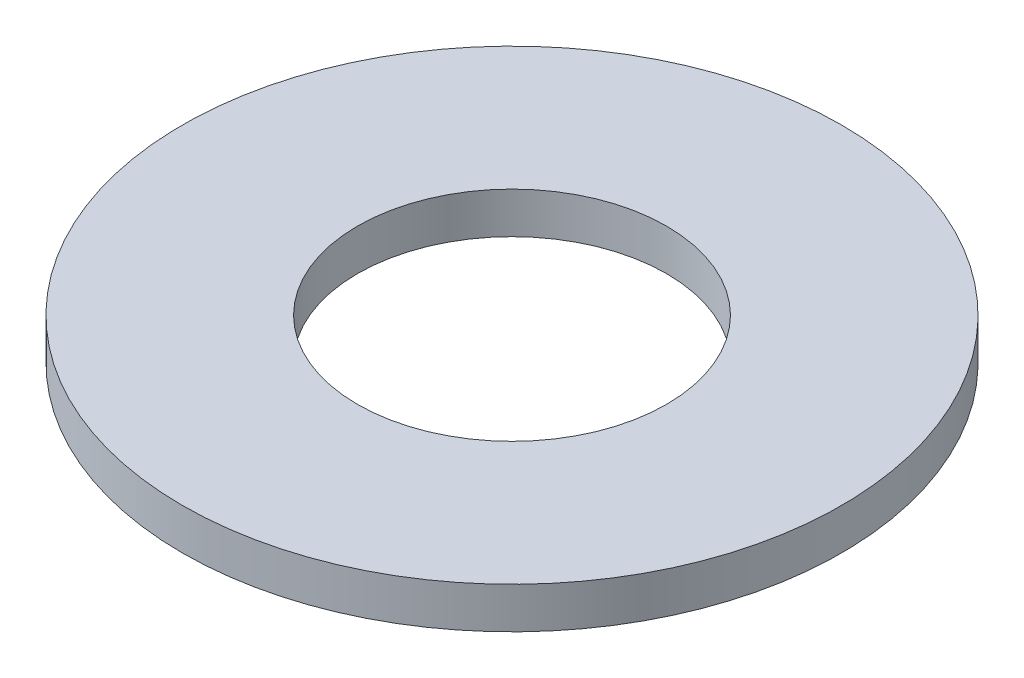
ISO-10303-21;
HEADER;
FILE_DESCRIPTION(('STEP AP214'),'2;1');
FILE_NAME('part.step','',(''),(''),'','','');
FILE_SCHEMA(('AUTOMOTIVE_DESIGN { 1 0 10303 214 1 1 1 1 }'));
ENDSEC;
DATA;
#1=APPLICATION_CONTEXT('core data for automotive mechanical design processes');
#2=APPLICATION_PROTOCOL_DEFINITION('international standard','automotive_design',2000,#1);
#3=PRODUCT_CONTEXT('',#1,'mechanical');
#4=PRODUCT('Part','Part','',(#3));
#5=PRODUCT_RELATED_PRODUCT_CATEGORY('part','',(#4));
#6=PRODUCT_DEFINITION_FORMATION('','',#4);
#7=PRODUCT_DEFINITION_CONTEXT('part definition',#1,'design');
#8=PRODUCT_DEFINITION('design','',#6,#7);
#9=PRODUCT_DEFINITION_SHAPE('','',#8);
#10=(LENGTH_UNIT() NAMED_UNIT(*) SI_UNIT(.MILLI.,.METRE.));
#11=(NAMED_UNIT(*) PLANE_ANGLE_UNIT() SI_UNIT($,.RADIAN.));
#12=(NAMED_UNIT(*) SI_UNIT($,.STERADIAN.) SOLID_ANGLE_UNIT());
#13=UNCERTAINTY_MEASURE_WITH_UNIT(LENGTH_MEASURE(1.E-05),#10,'distance_accuracy_value','');
#14=(GEOMETRIC_REPRESENTATION_CONTEXT(3) GLOBAL_UNCERTAINTY_ASSIGNED_CONTEXT((#13)) GLOBAL_UNIT_ASSIGNED_CONTEXT((#10,
#11,#12)) REPRESENTATION_CONTEXT('',''));
#15=CARTESIAN_POINT('',(0.,0.,0.));
#16=DIRECTION('',(0.,0.,1.));
#17=DIRECTION('',(1.,0.,0.));
#18=AXIS2_PLACEMENT_3D('',#15,#16,#17);
#19=CARTESIAN_POINT('',(0.,6.35,0.));
#20=DIRECTION('',(0.,-1.,0.));
#21=DIRECTION('',(0.,0.,-1.));
#22=AXIS2_PLACEMENT_3D('',#19,#20,#21);
#23=CYLINDRICAL_SURFACE('',#22,50.8);
#24=CARTESIAN_POINT('',(0.,6.35,0.));
#25=DIRECTION('',(0.,1.,0.));
#26=DIRECTION('',(0.,0.,1.));
#27=AXIS2_PLACEMENT_3D('',#24,#25,#26);
#28=CIRCLE('',#27,50.8);
#29=CARTESIAN_POINT('',(0.,6.35,50.8));
#30=VERTEX_POINT('',#29);
#31=EDGE_CURVE('E10',#30,#30,#28,.T.);
#32=ORIENTED_EDGE('',*,*,#31,.F.);
#33=EDGE_LOOP('',(#32));
#34=FACE_BOUND('',#33,.T.);
#35=CARTESIAN_POINT('',(0.,0.,0.));
#36=DIRECTION('',(0.,1.,0.));
#37=DIRECTION('',(0.,0.,1.));
#38=AXIS2_PLACEMENT_3D('',#35,#36,#37);
#39=CIRCLE('',#38,50.8);
#40=CARTESIAN_POINT('',(0.,0.,50.8));
#41=VERTEX_POINT('',#40);
#42=EDGE_CURVE('E32',#41,#41,#39,.T.);
#43=ORIENTED_EDGE('',*,*,#42,.T.);
#44=EDGE_LOOP('',(#43));
#45=FACE_BOUND('',#44,.T.);
#46=ADVANCED_FACE('F29',(#34,#45),#23,.T.);
#47=CARTESIAN_POINT('',(0.,6.35,0.));
#48=DIRECTION('',(0.,1.,0.));
#49=DIRECTION('',(0.,0.,1.));
#50=AXIS2_PLACEMENT_3D('',#47,#48,#49);
#51=PLANE('',#50);
#52=CARTESIAN_POINT('',(0.,6.35,0.));
#53=DIRECTION('',(0.,1.,0.));
#54=DIRECTION('',(0.,0.,1.));
#55=AXIS2_PLACEMENT_3D('',#52,#53,#54);
#56=CIRCLE('',#55,23.8125);
#57=CARTESIAN_POINT('',(0.,6.35,23.8125));
#58=VERTEX_POINT('',#57);
#59=EDGE_CURVE('E41',#58,#58,#56,.T.);
#60=ORIENTED_EDGE('',*,*,#59,.F.);
#61=EDGE_LOOP('',(#60));
#62=FACE_BOUND('',#61,.T.);
#63=ORIENTED_EDGE('',*,*,#31,.T.);
#64=EDGE_LOOP('',(#63));
#65=FACE_BOUND('',#64,.T.);
#66=ADVANCED_FACE('F56',(#62,#65),#51,.T.);
#67=CARTESIAN_POINT('',(0.,0.,0.));
#68=DIRECTION('',(0.,1.,0.));
#69=DIRECTION('',(0.,0.,1.));
#70=AXIS2_PLACEMENT_3D('',#67,#68,#69);
#71=PLANE('',#70);
#72=CARTESIAN_POINT('',(0.,0.,0.));
#73=DIRECTION('',(0.,1.,0.));
#74=DIRECTION('',(0.,0.,1.));
#75=AXIS2_PLACEMENT_3D('',#72,#73,#74);
#76=CIRCLE('',#75,23.8125);
#77=CARTESIAN_POINT('',(0.,0.,23.8125));
#78=VERTEX_POINT('',#77);
#79=EDGE_CURVE('E39',#78,#78,#76,.T.);
#80=ORIENTED_EDGE('',*,*,#79,.T.);
#81=EDGE_LOOP('',(#80));
#82=FACE_BOUND('',#81,.T.);
#83=ORIENTED_EDGE('',*,*,#42,.F.);
#84=EDGE_LOOP('',(#83));
#85=FACE_BOUND('',#84,.T.);
#86=ADVANCED_FACE('F47',(#82,#85),#71,.F.);
#87=CARTESIAN_POINT('',(0.,0.,0.));
#88=DIRECTION('',(0.,1.,0.));
#89=DIRECTION('',(0.,0.,1.));
#90=AXIS2_PLACEMENT_3D('',#87,#88,#89);
#91=CYLINDRICAL_SURFACE('',#90,23.8125);
#92=ORIENTED_EDGE('',*,*,#79,.F.);
#93=EDGE_LOOP('',(#92));
#94=FACE_BOUND('',#93,.T.);
#95=ORIENTED_EDGE('',*,*,#59,.T.);
#96=EDGE_LOOP('',(#95));
#97=FACE_BOUND('',#96,.T.);
#98=ADVANCED_FACE('F50',(#94,#97),#91,.F.);
#99=CLOSED_SHELL('',(#46,#66,#86,#98));
#100=MANIFOLD_SOLID_BREP('B2',#99);
#101=ADVANCED_BREP_SHAPE_REPRESENTATION('',(#18,#100),#14);
#102=SHAPE_DEFINITION_REPRESENTATION(#9,#101);
ENDSEC;
END-ISO-10303-21;
